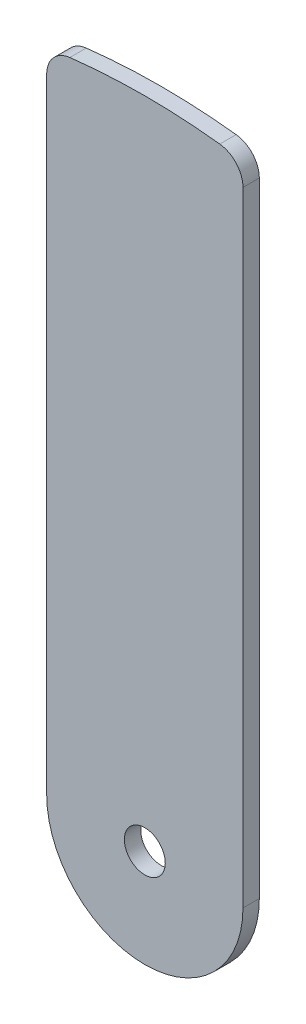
ISO-10303-21;
HEADER;
FILE_DESCRIPTION(('STEP AP214'),'2;1');
FILE_NAME('part.step','',(''),(''),'','','');
FILE_SCHEMA(('AUTOMOTIVE_DESIGN { 1 0 10303 214 1 1 1 1 }'));
ENDSEC;
DATA;
#1=APPLICATION_CONTEXT('core data for automotive mechanical design processes');
#2=APPLICATION_PROTOCOL_DEFINITION('international standard','automotive_design',2000,#1);
#3=PRODUCT_CONTEXT('',#1,'mechanical');
#4=PRODUCT('Part','Part','',(#3));
#5=PRODUCT_RELATED_PRODUCT_CATEGORY('part','',(#4));
#6=PRODUCT_DEFINITION_FORMATION('','',#4);
#7=PRODUCT_DEFINITION_CONTEXT('part definition',#1,'design');
#8=PRODUCT_DEFINITION('design','',#6,#7);
#9=PRODUCT_DEFINITION_SHAPE('','',#8);
#10=(LENGTH_UNIT() NAMED_UNIT(*) SI_UNIT(.MILLI.,.METRE.));
#11=(NAMED_UNIT(*) PLANE_ANGLE_UNIT() SI_UNIT($,.RADIAN.));
#12=(NAMED_UNIT(*) SI_UNIT($,.STERADIAN.) SOLID_ANGLE_UNIT());
#13=UNCERTAINTY_MEASURE_WITH_UNIT(LENGTH_MEASURE(1.E-05),#10,'distance_accuracy_value','');
#14=(GEOMETRIC_REPRESENTATION_CONTEXT(3) GLOBAL_UNCERTAINTY_ASSIGNED_CONTEXT((#13)) GLOBAL_UNIT_ASSIGNED_CONTEXT((#10,
#11,#12)) REPRESENTATION_CONTEXT('',''));
#15=CARTESIAN_POINT('',(0.,0.,0.));
#16=DIRECTION('',(0.,0.,1.));
#17=DIRECTION('',(1.,0.,0.));
#18=AXIS2_PLACEMENT_3D('',#15,#16,#17);
#19=CARTESIAN_POINT('',(19.05,0.,3.175));
#20=DIRECTION('',(-1.,0.,0.));
#21=DIRECTION('',(0.,0.,1.));
#22=AXIS2_PLACEMENT_3D('',#19,#20,#21);
#23=PLANE('',#22);
#24=DIRECTION('',(0.,1.,0.));
#25=VECTOR('',#24,1.);
#26=CARTESIAN_POINT('',(19.05,0.,0.));
#27=LINE('',#26,#25);
#28=CARTESIAN_POINT('',(19.05,0.,0.));
#29=VERTEX_POINT('',#28);
#30=CARTESIAN_POINT('',(19.05,121.116990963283,0.));
#31=VERTEX_POINT('',#30);
#32=EDGE_CURVE('E119',#29,#31,#27,.T.);
#33=ORIENTED_EDGE('',*,*,#32,.T.);
#34=DIRECTION('',(0.,0.,-1.));
#35=VECTOR('',#34,1.);
#36=CARTESIAN_POINT('',(19.05,121.116990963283,3.175));
#37=LINE('',#36,#35);
#38=CARTESIAN_POINT('',(19.05,121.116990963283,3.175));
#39=VERTEX_POINT('',#38);
#40=EDGE_CURVE('E11',#31,#39,#37,.F.);
#41=ORIENTED_EDGE('',*,*,#40,.T.);
#42=DIRECTION('',(0.,1.,0.));
#43=VECTOR('',#42,1.);
#44=CARTESIAN_POINT('',(19.05,0.,3.175));
#45=LINE('',#44,#43);
#46=CARTESIAN_POINT('',(19.05,0.,3.175));
#47=VERTEX_POINT('',#46);
#48=EDGE_CURVE('E112',#47,#39,#45,.T.);
#49=ORIENTED_EDGE('',*,*,#48,.F.);
#50=DIRECTION('',(0.,0.,-1.));
#51=VECTOR('',#50,1.);
#52=CARTESIAN_POINT('',(19.05,0.,3.175));
#53=LINE('',#52,#51);
#54=EDGE_CURVE('E100',#47,#29,#53,.T.);
#55=ORIENTED_EDGE('',*,*,#54,.T.);
#56=EDGE_LOOP('',(#33,#41,#49,#55));
#57=FACE_BOUND('',#56,.T.);
#58=ADVANCED_FACE('F33',(#57),#23,.F.);
#59=CARTESIAN_POINT('',(0.,0.,3.175));
#60=DIRECTION('',(0.,0.,-1.));
#61=DIRECTION('',(-1.,0.,0.));
#62=AXIS2_PLACEMENT_3D('',#59,#60,#61);
#63=CYLINDRICAL_SURFACE('',#62,127.);
#64=CARTESIAN_POINT('',(0.,0.,0.));
#65=DIRECTION('',(0.,0.,1.));
#66=DIRECTION('',(1.,0.,0.));
#67=AXIS2_PLACEMENT_3D('',#64,#65,#66);
#68=CIRCLE('',#67,127.);
#69=CARTESIAN_POINT('',(14.5520833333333,126.16353225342,0.));
#70=VERTEX_POINT('',#69);
#71=CARTESIAN_POINT('',(-14.5520833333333,126.16353225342,0.));
#72=VERTEX_POINT('',#71);
#73=EDGE_CURVE('E121',#70,#72,#68,.T.);
#74=ORIENTED_EDGE('',*,*,#73,.T.);
#75=DIRECTION('',(0.,0.,-1.));
#76=VECTOR('',#75,1.);
#77=CARTESIAN_POINT('',(-14.5520833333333,126.16353225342,3.175));
#78=LINE('',#77,#76);
#79=CARTESIAN_POINT('',(-14.5520833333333,126.16353225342,3.175));
#80=VERTEX_POINT('',#79);
#81=EDGE_CURVE('E54',#72,#80,#78,.F.);
#82=ORIENTED_EDGE('',*,*,#81,.T.);
#83=CARTESIAN_POINT('',(0.,0.,3.175));
#84=DIRECTION('',(0.,0.,1.));
#85=DIRECTION('',(1.,0.,0.));
#86=AXIS2_PLACEMENT_3D('',#83,#84,#85);
#87=CIRCLE('',#86,127.);
#88=CARTESIAN_POINT('',(14.5520833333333,126.16353225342,3.175));
#89=VERTEX_POINT('',#88);
#90=EDGE_CURVE('E110',#89,#80,#87,.T.);
#91=ORIENTED_EDGE('',*,*,#90,.F.);
#92=DIRECTION('',(0.,0.,-1.));
#93=VECTOR('',#92,1.);
#94=CARTESIAN_POINT('',(14.5520833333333,126.16353225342,3.175));
#95=LINE('',#94,#93);
#96=EDGE_CURVE('E133',#89,#70,#95,.T.);
#97=ORIENTED_EDGE('',*,*,#96,.T.);
#98=EDGE_LOOP('',(#74,#82,#91,#97));
#99=FACE_BOUND('',#98,.T.);
#100=ADVANCED_FACE('F141',(#99),#63,.T.);
#101=CARTESIAN_POINT('',(-19.05,0.,3.175));
#102=DIRECTION('',(-1.,0.,0.));
#103=DIRECTION('',(0.,0.,1.));
#104=AXIS2_PLACEMENT_3D('',#101,#102,#103);
#105=PLANE('',#104);
#106=DIRECTION('',(0.,1.,0.));
#107=VECTOR('',#106,1.);
#108=CARTESIAN_POINT('',(-19.05,0.,3.175));
#109=LINE('',#108,#107);
#110=CARTESIAN_POINT('',(-19.05,0.,3.175));
#111=VERTEX_POINT('',#110);
#112=CARTESIAN_POINT('',(-19.05,121.116990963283,3.175));
#113=VERTEX_POINT('',#112);
#114=EDGE_CURVE('E93',#111,#113,#109,.T.);
#115=ORIENTED_EDGE('',*,*,#114,.T.);
#116=DIRECTION('',(0.,0.,1.));
#117=VECTOR('',#116,1.);
#118=CARTESIAN_POINT('',(-19.05,121.116990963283,0.));
#119=LINE('',#118,#117);
#120=CARTESIAN_POINT('',(-19.05,121.116990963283,0.));
#121=VERTEX_POINT('',#120);
#122=EDGE_CURVE('E99',#113,#121,#119,.F.);
#123=ORIENTED_EDGE('',*,*,#122,.T.);
#124=DIRECTION('',(0.,1.,0.));
#125=VECTOR('',#124,1.);
#126=CARTESIAN_POINT('',(-19.05,0.,0.));
#127=LINE('',#126,#125);
#128=CARTESIAN_POINT('',(-19.05,0.,0.));
#129=VERTEX_POINT('',#128);
#130=EDGE_CURVE('E96',#129,#121,#127,.T.);
#131=ORIENTED_EDGE('',*,*,#130,.F.);
#132=DIRECTION('',(0.,0.,-1.));
#133=VECTOR('',#132,1.);
#134=CARTESIAN_POINT('',(-19.05,0.,3.175));
#135=LINE('',#134,#133);
#136=EDGE_CURVE('E88',#111,#129,#135,.T.);
#137=ORIENTED_EDGE('',*,*,#136,.F.);
#138=EDGE_LOOP('',(#115,#123,#131,#137));
#139=FACE_BOUND('',#138,.T.);
#140=ADVANCED_FACE('F90',(#139),#105,.T.);
#141=CARTESIAN_POINT('',(0.,0.,3.175));
#142=DIRECTION('',(0.,0.,-1.));
#143=DIRECTION('',(-1.,0.,0.));
#144=AXIS2_PLACEMENT_3D('',#141,#142,#143);
#145=CYLINDRICAL_SURFACE('',#144,3.96875);
#146=CARTESIAN_POINT('',(0.,0.,3.175));
#147=DIRECTION('',(0.,0.,1.));
#148=DIRECTION('',(1.,0.,0.));
#149=AXIS2_PLACEMENT_3D('',#146,#147,#148);
#150=CIRCLE('',#149,3.96875);
#151=CARTESIAN_POINT('',(3.96875,0.,3.175));
#152=VERTEX_POINT('',#151);
#153=EDGE_CURVE('E126',#152,#152,#150,.T.);
#154=ORIENTED_EDGE('',*,*,#153,.T.);
#155=EDGE_LOOP('',(#154));
#156=FACE_BOUND('',#155,.T.);
#157=CARTESIAN_POINT('',(0.,0.,0.));
#158=DIRECTION('',(0.,0.,1.));
#159=DIRECTION('',(1.,0.,0.));
#160=AXIS2_PLACEMENT_3D('',#157,#158,#159);
#161=CIRCLE('',#160,3.96875);
#162=CARTESIAN_POINT('',(3.96875,0.,0.));
#163=VERTEX_POINT('',#162);
#164=EDGE_CURVE('E116',#163,#163,#161,.T.);
#165=ORIENTED_EDGE('',*,*,#164,.F.);
#166=EDGE_LOOP('',(#165));
#167=FACE_BOUND('',#166,.T.);
#168=ADVANCED_FACE('F150',(#156,#167),#145,.F.);
#169=CARTESIAN_POINT('',(0.,0.,3.175));
#170=DIRECTION('',(0.,0.,-1.));
#171=DIRECTION('',(-1.,0.,0.));
#172=AXIS2_PLACEMENT_3D('',#169,#170,#171);
#173=CYLINDRICAL_SURFACE('',#172,19.05);
#174=CARTESIAN_POINT('',(0.,0.,0.));
#175=DIRECTION('',(0.,0.,1.));
#176=DIRECTION('',(1.,0.,0.));
#177=AXIS2_PLACEMENT_3D('',#174,#175,#176);
#178=CIRCLE('',#177,19.05);
#179=EDGE_CURVE('E124',#129,#29,#178,.T.);
#180=ORIENTED_EDGE('',*,*,#179,.T.);
#181=ORIENTED_EDGE('',*,*,#54,.F.);
#182=CARTESIAN_POINT('',(0.,0.,3.175));
#183=DIRECTION('',(0.,0.,1.));
#184=DIRECTION('',(1.,0.,0.));
#185=AXIS2_PLACEMENT_3D('',#182,#183,#184);
#186=CIRCLE('',#185,19.05);
#187=EDGE_CURVE('E103',#111,#47,#186,.T.);
#188=ORIENTED_EDGE('',*,*,#187,.F.);
#189=ORIENTED_EDGE('',*,*,#136,.T.);
#190=EDGE_LOOP('',(#180,#181,#188,#189));
#191=FACE_BOUND('',#190,.T.);
#192=ADVANCED_FACE('F104',(#191),#173,.T.);
#193=CARTESIAN_POINT('',(0.,0.,3.175));
#194=DIRECTION('',(0.,0.,1.));
#195=DIRECTION('',(1.,0.,0.));
#196=AXIS2_PLACEMENT_3D('',#193,#194,#195);
#197=PLANE('',#196);
#198=ORIENTED_EDGE('',*,*,#153,.F.);
#199=EDGE_LOOP('',(#198));
#200=FACE_BOUND('',#199,.T.);
#201=ORIENTED_EDGE('',*,*,#90,.T.);
#202=CARTESIAN_POINT('',(-13.97,121.116990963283,3.175));
#203=DIRECTION('',(0.,0.,1.));
#204=DIRECTION('',(1.,0.,0.));
#205=AXIS2_PLACEMENT_3D('',#202,#203,#204);
#206=CIRCLE('',#205,5.08);
#207=EDGE_CURVE('E41',#80,#113,#206,.T.);
#208=ORIENTED_EDGE('',*,*,#207,.T.);
#209=ORIENTED_EDGE('',*,*,#114,.F.);
#210=ORIENTED_EDGE('',*,*,#187,.T.);
#211=ORIENTED_EDGE('',*,*,#48,.T.);
#212=CARTESIAN_POINT('',(13.97,121.116990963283,3.175));
#213=DIRECTION('',(0.,0.,1.));
#214=DIRECTION('',(1.,0.,0.));
#215=AXIS2_PLACEMENT_3D('',#212,#213,#214);
#216=CIRCLE('',#215,5.08);
#217=EDGE_CURVE('E137',#39,#89,#216,.T.);
#218=ORIENTED_EDGE('',*,*,#217,.T.);
#219=EDGE_LOOP('',(#201,#208,#209,#210,#211,#218));
#220=FACE_BOUND('',#219,.T.);
#221=ADVANCED_FACE('F108',(#200,#220),#197,.T.);
#222=CARTESIAN_POINT('',(0.,0.,0.));
#223=DIRECTION('',(0.,0.,1.));
#224=DIRECTION('',(1.,0.,0.));
#225=AXIS2_PLACEMENT_3D('',#222,#223,#224);
#226=PLANE('',#225);
#227=ORIENTED_EDGE('',*,*,#164,.T.);
#228=EDGE_LOOP('',(#227));
#229=FACE_BOUND('',#228,.T.);
#230=ORIENTED_EDGE('',*,*,#130,.T.);
#231=CARTESIAN_POINT('',(-13.97,121.116990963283,0.));
#232=DIRECTION('',(0.,0.,1.));
#233=DIRECTION('',(1.,0.,0.));
#234=AXIS2_PLACEMENT_3D('',#231,#232,#233);
#235=CIRCLE('',#234,5.08);
#236=EDGE_CURVE('E131',#121,#72,#235,.F.);
#237=ORIENTED_EDGE('',*,*,#236,.T.);
#238=ORIENTED_EDGE('',*,*,#73,.F.);
#239=CARTESIAN_POINT('',(13.97,121.116990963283,0.));
#240=DIRECTION('',(0.,0.,1.));
#241=DIRECTION('',(1.,0.,0.));
#242=AXIS2_PLACEMENT_3D('',#239,#240,#241);
#243=CIRCLE('',#242,5.08);
#244=EDGE_CURVE('E129',#70,#31,#243,.F.);
#245=ORIENTED_EDGE('',*,*,#244,.T.);
#246=ORIENTED_EDGE('',*,*,#32,.F.);
#247=ORIENTED_EDGE('',*,*,#179,.F.);
#248=EDGE_LOOP('',(#230,#237,#238,#245,#246,#247));
#249=FACE_BOUND('',#248,.T.);
#250=ADVANCED_FACE('F145',(#229,#249),#226,.F.);
#251=CARTESIAN_POINT('',(-13.97,121.116990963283,3.175));
#252=DIRECTION('',(0.,0.,-1.));
#253=DIRECTION('',(-1.,0.,0.));
#254=AXIS2_PLACEMENT_3D('',#251,#252,#253);
#255=CYLINDRICAL_SURFACE('',#254,5.08);
#256=ORIENTED_EDGE('',*,*,#207,.F.);
#257=ORIENTED_EDGE('',*,*,#81,.F.);
#258=ORIENTED_EDGE('',*,*,#236,.F.);
#259=ORIENTED_EDGE('',*,*,#122,.F.);
#260=EDGE_LOOP('',(#256,#257,#258,#259));
#261=FACE_BOUND('',#260,.T.);
#262=ADVANCED_FACE('F159',(#261),#255,.T.);
#263=CARTESIAN_POINT('',(13.97,121.116990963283,3.175));
#264=DIRECTION('',(0.,0.,-1.));
#265=DIRECTION('',(-1.,0.,0.));
#266=AXIS2_PLACEMENT_3D('',#263,#264,#265);
#267=CYLINDRICAL_SURFACE('',#266,5.08);
#268=ORIENTED_EDGE('',*,*,#217,.F.);
#269=ORIENTED_EDGE('',*,*,#40,.F.);
#270=ORIENTED_EDGE('',*,*,#244,.F.);
#271=ORIENTED_EDGE('',*,*,#96,.F.);
#272=EDGE_LOOP('',(#268,#269,#270,#271));
#273=FACE_BOUND('',#272,.T.);
#274=ADVANCED_FACE('F35',(#273),#267,.T.);
#275=CLOSED_SHELL('',(#58,#100,#140,#168,#192,#221,#250,#262,#274));
#276=MANIFOLD_SOLID_BREP('B2',#275);
#277=ADVANCED_BREP_SHAPE_REPRESENTATION('',(#18,#276),#14);
#278=SHAPE_DEFINITION_REPRESENTATION(#9,#277);
ENDSEC;
END-ISO-10303-21;
